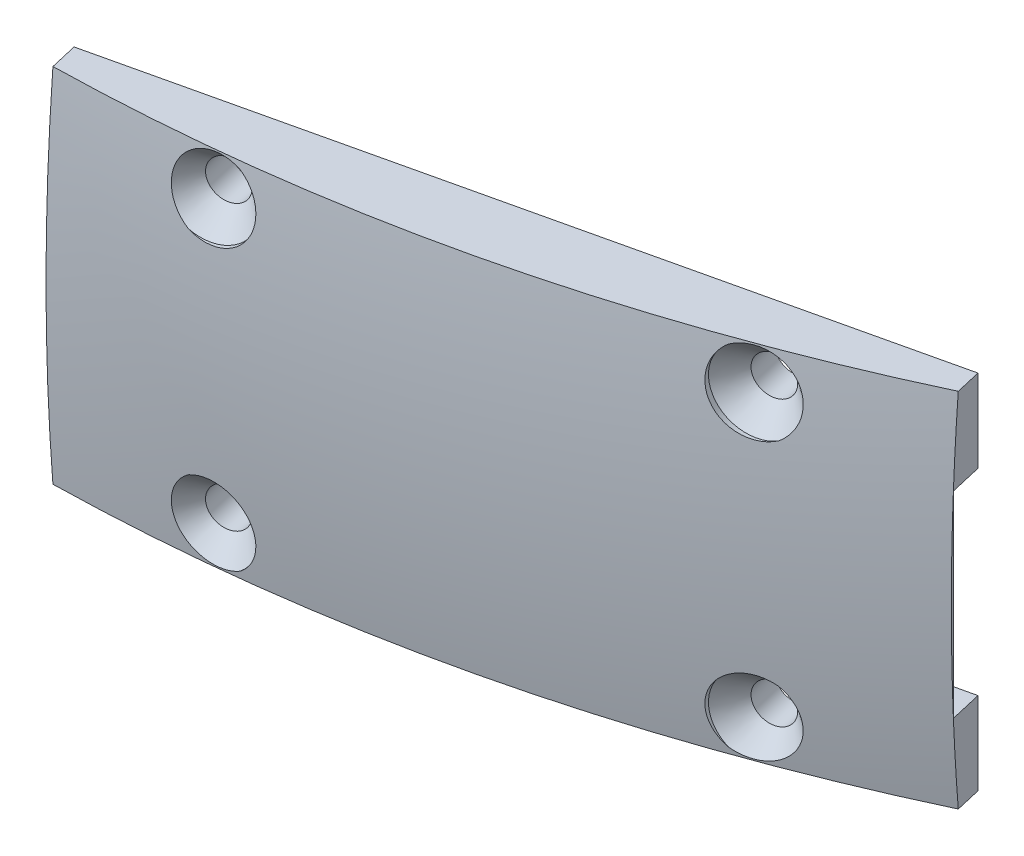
ISO-10303-21;
HEADER;
FILE_DESCRIPTION(('STEP AP214'),'2;1');
FILE_NAME('part.step','',(''),(''),'','','');
FILE_SCHEMA(('AUTOMOTIVE_DESIGN { 1 0 10303 214 1 1 1 1 }'));
ENDSEC;
DATA;
#1=APPLICATION_CONTEXT('core data for automotive mechanical design processes');
#2=APPLICATION_PROTOCOL_DEFINITION('international standard','automotive_design',2000,#1);
#3=PRODUCT_CONTEXT('',#1,'mechanical');
#4=PRODUCT('Part','Part','',(#3));
#5=PRODUCT_RELATED_PRODUCT_CATEGORY('part','',(#4));
#6=PRODUCT_DEFINITION_FORMATION('','',#4);
#7=PRODUCT_DEFINITION_CONTEXT('part definition',#1,'design');
#8=PRODUCT_DEFINITION('design','',#6,#7);
#9=PRODUCT_DEFINITION_SHAPE('','',#8);
#10=(LENGTH_UNIT() NAMED_UNIT(*) SI_UNIT(.MILLI.,.METRE.));
#11=(NAMED_UNIT(*) PLANE_ANGLE_UNIT() SI_UNIT($,.RADIAN.));
#12=(NAMED_UNIT(*) SI_UNIT($,.STERADIAN.) SOLID_ANGLE_UNIT());
#13=UNCERTAINTY_MEASURE_WITH_UNIT(LENGTH_MEASURE(1.E-05),#10,'distance_accuracy_value','');
#14=(GEOMETRIC_REPRESENTATION_CONTEXT(3) GLOBAL_UNCERTAINTY_ASSIGNED_CONTEXT((#13)) GLOBAL_UNIT_ASSIGNED_CONTEXT((#10,
#11,#12)) REPRESENTATION_CONTEXT('',''));
#15=CARTESIAN_POINT('',(0.,0.,0.));
#16=DIRECTION('',(0.,0.,1.));
#17=DIRECTION('',(1.,0.,0.));
#18=AXIS2_PLACEMENT_3D('',#15,#16,#17);
#19=CARTESIAN_POINT('',(244.475000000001,8.255,152.4));
#20=DIRECTION('',(0.,1.,0.));
#21=DIRECTION('',(0.,0.,1.));
#22=AXIS2_PLACEMENT_3D('',#19,#20,#21);
#23=PLANE('',#22);
#24=DIRECTION('',(-0.224951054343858,0.,-0.974370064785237));
#25=VECTOR('',#24,1.);
#26=CARTESIAN_POINT('',(128.521227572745,8.25500000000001,176.421263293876));
#27=LINE('',#26,#25);
#28=CARTESIAN_POINT('',(122.881130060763,8.255,151.991316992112));
#29=VERTEX_POINT('',#28);
#30=CARTESIAN_POINT('',(122.261187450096,8.25500000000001,149.306050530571));
#31=VERTEX_POINT('',#30);
#32=EDGE_CURVE('E169',#29,#31,#27,.T.);
#33=ORIENTED_EDGE('',*,*,#32,.T.);
#34=DIRECTION('',(0.974370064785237,0.,-0.224951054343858));
#35=VECTOR('',#34,1.);
#36=CARTESIAN_POINT('',(237.612468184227,8.255,122.675109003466));
#37=LINE('',#36,#35);
#38=CARTESIAN_POINT('',(183.87203358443,8.25500000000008,135.082065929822));
#39=VERTEX_POINT('',#38);
#40=EDGE_CURVE('E293',#31,#39,#37,.T.);
#41=ORIENTED_EDGE('',*,*,#40,.T.);
#42=DIRECTION('',(-0.224951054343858,0.,-0.974370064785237));
#43=VECTOR('',#42,1.);
#44=CARTESIAN_POINT('',(190.132073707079,8.25500000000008,162.197278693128));
#45=LINE('',#44,#43);
#46=CARTESIAN_POINT('',(184.491976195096,8.255,137.767332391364));
#47=VERTEX_POINT('',#46);
#48=EDGE_CURVE('E164',#47,#39,#45,.T.);
#49=ORIENTED_EDGE('',*,*,#48,.F.);
#50=DIRECTION('',(0.974370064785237,0.,-0.224951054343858));
#51=VECTOR('',#50,1.);
#52=CARTESIAN_POINT('',(121.110929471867,8.255,152.4));
#53=LINE('',#52,#51);
#54=EDGE_CURVE('E167',#29,#47,#53,.T.);
#55=ORIENTED_EDGE('',*,*,#54,.F.);
#56=EDGE_LOOP('',(#33,#41,#49,#55));
#57=FACE_BOUND('',#56,.T.);
#58=ADVANCED_FACE('F36',(#57),#23,.F.);
#59=CARTESIAN_POINT('',(244.475000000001,-8.255,152.4));
#60=DIRECTION('',(0.,1.,0.));
#61=DIRECTION('',(0.,0.,1.));
#62=AXIS2_PLACEMENT_3D('',#59,#60,#61);
#63=PLANE('',#62);
#64=DIRECTION('',(0.974370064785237,0.,-0.224951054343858));
#65=VECTOR('',#64,1.);
#66=CARTESIAN_POINT('',(237.612468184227,-8.255,122.675109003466));
#67=LINE('',#66,#65);
#68=CARTESIAN_POINT('',(122.261187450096,-8.255,149.306050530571));
#69=VERTEX_POINT('',#68);
#70=CARTESIAN_POINT('',(183.87203358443,-8.255,135.082065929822));
#71=VERTEX_POINT('',#70);
#72=EDGE_CURVE('E296',#69,#71,#67,.T.);
#73=ORIENTED_EDGE('',*,*,#72,.F.);
#74=DIRECTION('',(-0.224951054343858,0.,-0.974370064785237));
#75=VECTOR('',#74,1.);
#76=CARTESIAN_POINT('',(128.521227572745,-8.255,176.421263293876));
#77=LINE('',#76,#75);
#78=CARTESIAN_POINT('',(122.881130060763,-8.255,151.991316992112));
#79=VERTEX_POINT('',#78);
#80=EDGE_CURVE('E298',#79,#69,#77,.T.);
#81=ORIENTED_EDGE('',*,*,#80,.F.);
#82=DIRECTION('',(0.974370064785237,0.,-0.224951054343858));
#83=VECTOR('',#82,1.);
#84=CARTESIAN_POINT('',(121.110929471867,-8.255,152.4));
#85=LINE('',#84,#83);
#86=CARTESIAN_POINT('',(184.491976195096,-8.255,137.767332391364));
#87=VERTEX_POINT('',#86);
#88=EDGE_CURVE('E173',#79,#87,#85,.T.);
#89=ORIENTED_EDGE('',*,*,#88,.T.);
#90=DIRECTION('',(-0.224951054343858,0.,-0.974370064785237));
#91=VECTOR('',#90,1.);
#92=CARTESIAN_POINT('',(190.132073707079,-8.255,162.197278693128));
#93=LINE('',#92,#91);
#94=EDGE_CURVE('E300',#87,#71,#93,.T.);
#95=ORIENTED_EDGE('',*,*,#94,.T.);
#96=EDGE_LOOP('',(#73,#81,#89,#95));
#97=FACE_BOUND('',#96,.T.);
#98=ADVANCED_FACE('F233',(#97),#63,.T.);
#99=CARTESIAN_POINT('',(121.110929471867,-8.255,152.4));
#100=DIRECTION('',(0.224951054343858,0.,0.974370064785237));
#101=DIRECTION('',(0.974370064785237,0.,-0.224951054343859));
#102=AXIS2_PLACEMENT_3D('',#99,#100,#101);
#103=PLANE('',#102);
#104=ORIENTED_EDGE('',*,*,#88,.F.);
#105=DIRECTION('',(0.,1.,0.));
#106=VECTOR('',#105,1.);
#107=CARTESIAN_POINT('',(122.881130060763,-8.255,151.991316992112));
#108=LINE('',#107,#106);
#109=EDGE_CURVE('E279',#79,#29,#108,.T.);
#110=ORIENTED_EDGE('',*,*,#109,.T.);
#111=ORIENTED_EDGE('',*,*,#54,.T.);
#112=DIRECTION('',(0.,-1.,0.));
#113=VECTOR('',#112,1.);
#114=CARTESIAN_POINT('',(184.491976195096,-8.255,137.767332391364));
#115=LINE('',#114,#113);
#116=EDGE_CURVE('E287',#47,#87,#115,.T.);
#117=ORIENTED_EDGE('',*,*,#116,.T.);
#118=EDGE_LOOP('',(#104,#110,#111,#117));
#119=FACE_BOUND('',#118,.T.);
#120=ADVANCED_FACE('F219',(#119),#103,.F.);
#121=CARTESIAN_POINT('',(184.543454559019,-15.1765,137.990309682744));
#122=DIRECTION('',(-0.974370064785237,0.,0.224951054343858));
#123=DIRECTION('',(0.224951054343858,0.,0.974370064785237));
#124=AXIS2_PLACEMENT_3D('',#121,#122,#123);
#125=PLANE('',#124);
#126=DIRECTION('',(0.224951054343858,0.,0.974370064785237));
#127=VECTOR('',#126,1.);
#128=CARTESIAN_POINT('',(184.543454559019,-15.1765,137.990309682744));
#129=LINE('',#128,#127);
#130=CARTESIAN_POINT('',(183.87203358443,-15.1765,135.082065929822));
#131=VERTEX_POINT('',#130);
#132=CARTESIAN_POINT('',(184.369141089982,-15.1765,137.235275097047));
#133=VERTEX_POINT('',#132);
#134=EDGE_CURVE('E269',#131,#133,#129,.T.);
#135=ORIENTED_EDGE('',*,*,#134,.F.);
#136=DIRECTION('',(0.,1.,0.));
#137=VECTOR('',#136,1.);
#138=CARTESIAN_POINT('',(183.87203358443,-15.1765,135.082065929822));
#139=LINE('',#138,#137);
#140=EDGE_CURVE('E281',#131,#71,#139,.T.);
#141=ORIENTED_EDGE('',*,*,#140,.T.);
#142=ORIENTED_EDGE('',*,*,#94,.F.);
#143=CARTESIAN_POINT('',(151.0246042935,0.,-7.19578157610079));
#144=DIRECTION('',(-0.974370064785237,0.,0.224951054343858));
#145=DIRECTION('',(0.224951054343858,0.,0.974370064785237));
#146=AXIS2_PLACEMENT_3D('',#143,#144,#145);
#147=CIRCLE('',#146,149.005081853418);
#148=EDGE_CURVE('E292',#133,#87,#147,.T.);
#149=ORIENTED_EDGE('',*,*,#148,.F.);
#150=EDGE_LOOP('',(#135,#141,#142,#149));
#151=FACE_BOUND('',#150,.T.);
#152=ADVANCED_FACE('F217',(#151),#125,.F.);
#153=ORIENTED_EDGE('',*,*,#48,.T.);
#154=CARTESIAN_POINT('',(183.87203358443,15.1765,135.082065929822));
#155=VERTEX_POINT('',#154);
#156=EDGE_CURVE('E275',#39,#155,#139,.T.);
#157=ORIENTED_EDGE('',*,*,#156,.T.);
#158=DIRECTION('',(0.224951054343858,0.,0.974370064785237));
#159=VECTOR('',#158,1.);
#160=CARTESIAN_POINT('',(184.543454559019,15.1765,137.990309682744));
#161=LINE('',#160,#159);
#162=CARTESIAN_POINT('',(184.369141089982,15.1765,137.235275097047));
#163=VERTEX_POINT('',#162);
#164=EDGE_CURVE('E252',#155,#163,#161,.T.);
#165=ORIENTED_EDGE('',*,*,#164,.T.);
#166=EDGE_CURVE('E159',#47,#163,#147,.T.);
#167=ORIENTED_EDGE('',*,*,#166,.F.);
#168=EDGE_LOOP('',(#153,#157,#165,#167));
#169=FACE_BOUND('',#168,.T.);
#170=ADVANCED_FACE('F215',(#169),#125,.F.);
#171=CARTESIAN_POINT('',(122.968146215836,-15.1765,152.368225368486));
#172=DIRECTION('',(0.974370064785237,0.,-0.224951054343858));
#173=DIRECTION('',(-0.224951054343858,0.,-0.974370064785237));
#174=AXIS2_PLACEMENT_3D('',#171,#172,#173);
#175=PLANE('',#174);
#176=DIRECTION('',(-0.224951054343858,0.,-0.974370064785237));
#177=VECTOR('',#176,1.);
#178=CARTESIAN_POINT('',(122.968146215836,15.1765,152.368225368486));
#179=LINE('',#178,#177);
#180=CARTESIAN_POINT('',(122.794018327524,15.1765,151.613994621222));
#181=VERTEX_POINT('',#180);
#182=CARTESIAN_POINT('',(122.261187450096,15.1765,149.306050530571));
#183=VERTEX_POINT('',#182);
#184=EDGE_CURVE('E251',#181,#183,#179,.T.);
#185=ORIENTED_EDGE('',*,*,#184,.T.);
#186=DIRECTION('',(0.,1.,0.));
#187=VECTOR('',#186,1.);
#188=CARTESIAN_POINT('',(122.261187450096,-15.1765,149.306050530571));
#189=LINE('',#188,#187);
#190=EDGE_CURVE('E280',#31,#183,#189,.T.);
#191=ORIENTED_EDGE('',*,*,#190,.F.);
#192=ORIENTED_EDGE('',*,*,#32,.F.);
#193=ORIENTED_EDGE('',*,*,#109,.F.);
#194=ORIENTED_EDGE('',*,*,#80,.T.);
#195=CARTESIAN_POINT('',(122.261187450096,-15.1765,149.306050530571));
#196=VERTEX_POINT('',#195);
#197=EDGE_CURVE('E276',#196,#69,#189,.T.);
#198=ORIENTED_EDGE('',*,*,#197,.F.);
#199=DIRECTION('',(-0.224951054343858,0.,-0.974370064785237));
#200=VECTOR('',#199,1.);
#201=CARTESIAN_POINT('',(122.968146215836,-15.1765,152.368225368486));
#202=LINE('',#201,#200);
#203=CARTESIAN_POINT('',(122.794018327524,-15.1765,151.613994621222));
#204=VERTEX_POINT('',#203);
#205=EDGE_CURVE('E272',#204,#196,#202,.T.);
#206=ORIENTED_EDGE('',*,*,#205,.F.);
#207=CARTESIAN_POINT('',(89.4137581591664,0.,7.02820302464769));
#208=DIRECTION('',(0.974370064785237,0.,-0.224951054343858));
#209=DIRECTION('',(-0.224951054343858,0.,-0.974370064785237));
#210=AXIS2_PLACEMENT_3D('',#207,#208,#209);
#211=CIRCLE('',#210,149.163061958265);
#212=EDGE_CURVE('E156',#181,#204,#211,.T.);
#213=ORIENTED_EDGE('',*,*,#212,.F.);
#214=EDGE_LOOP('',(#185,#191,#192,#193,#194,#198,#206,#213));
#215=FACE_BOUND('',#214,.T.);
#216=ADVANCED_FACE('F211',(#215),#175,.F.);
#217=CARTESIAN_POINT('',(122.261187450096,-15.1765,149.306050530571));
#218=DIRECTION('',(0.224951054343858,0.,0.974370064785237));
#219=DIRECTION('',(0.974370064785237,0.,-0.224951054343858));
#220=AXIS2_PLACEMENT_3D('',#217,#218,#219);
#221=PLANE('',#220);
#222=CARTESIAN_POINT('',(134.497779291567,11.90625,146.481010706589));
#223=DIRECTION('',(-0.224951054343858,0.,-0.974370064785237));
#224=DIRECTION('',(-0.974370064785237,0.,0.224951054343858));
#225=AXIS2_PLACEMENT_3D('',#222,#223,#224);
#226=CIRCLE('',#225,1.63194999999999);
#227=CARTESIAN_POINT('',(132.907656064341,11.90625,146.848119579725));
#228=VERTEX_POINT('',#227);
#229=EDGE_CURVE('E483',#228,#228,#226,.T.);
#230=ORIENTED_EDGE('',*,*,#229,.F.);
#231=EDGE_LOOP('',(#230));
#232=FACE_BOUND('',#231,.T.);
#233=CARTESIAN_POINT('',(171.621278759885,11.90625,137.910375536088));
#234=DIRECTION('',(-0.224951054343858,0.,-0.974370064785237));
#235=DIRECTION('',(-0.974370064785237,0.,0.224951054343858));
#236=AXIS2_PLACEMENT_3D('',#233,#234,#235);
#237=CIRCLE('',#236,1.63194999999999);
#238=CARTESIAN_POINT('',(170.031155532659,11.90625,138.277484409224));
#239=VERTEX_POINT('',#238);
#240=EDGE_CURVE('E261',#239,#239,#237,.T.);
#241=ORIENTED_EDGE('',*,*,#240,.F.);
#242=EDGE_LOOP('',(#241));
#243=FACE_BOUND('',#242,.T.);
#244=ORIENTED_EDGE('',*,*,#190,.T.);
#245=DIRECTION('',(0.974370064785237,0.,-0.224951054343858));
#246=VECTOR('',#245,1.);
#247=CARTESIAN_POINT('',(122.261187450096,15.1765,149.306050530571));
#248=LINE('',#247,#246);
#249=EDGE_CURVE('E250',#183,#155,#248,.T.);
#250=ORIENTED_EDGE('',*,*,#249,.T.);
#251=ORIENTED_EDGE('',*,*,#156,.F.);
#252=ORIENTED_EDGE('',*,*,#40,.F.);
#253=EDGE_LOOP('',(#244,#250,#251,#252));
#254=FACE_BOUND('',#253,.T.);
#255=ADVANCED_FACE('F214',(#232,#243,#254),#221,.F.);
#256=CARTESIAN_POINT('',(171.621278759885,-11.90625,137.910375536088));
#257=DIRECTION('',(-0.224951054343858,0.,-0.974370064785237));
#258=DIRECTION('',(-0.974370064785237,0.,0.224951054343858));
#259=AXIS2_PLACEMENT_3D('',#256,#257,#258);
#260=CIRCLE('',#259,1.63194999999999);
#261=CARTESIAN_POINT('',(170.031155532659,-11.90625,138.277484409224));
#262=VERTEX_POINT('',#261);
#263=EDGE_CURVE('E133',#262,#262,#260,.T.);
#264=ORIENTED_EDGE('',*,*,#263,.F.);
#265=EDGE_LOOP('',(#264));
#266=FACE_BOUND('',#265,.T.);
#267=CARTESIAN_POINT('',(134.497779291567,-11.90625,146.481010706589));
#268=DIRECTION('',(-0.224951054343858,0.,-0.974370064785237));
#269=DIRECTION('',(-0.974370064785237,0.,0.224951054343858));
#270=AXIS2_PLACEMENT_3D('',#267,#268,#269);
#271=CIRCLE('',#270,1.63194999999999);
#272=CARTESIAN_POINT('',(132.907656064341,-11.90625,146.848119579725));
#273=VERTEX_POINT('',#272);
#274=EDGE_CURVE('E494',#273,#273,#271,.T.);
#275=ORIENTED_EDGE('',*,*,#274,.F.);
#276=EDGE_LOOP('',(#275));
#277=FACE_BOUND('',#276,.T.);
#278=ORIENTED_EDGE('',*,*,#72,.T.);
#279=ORIENTED_EDGE('',*,*,#140,.F.);
#280=DIRECTION('',(0.974370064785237,0.,-0.224951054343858));
#281=VECTOR('',#280,1.);
#282=CARTESIAN_POINT('',(122.261187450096,-15.1765,149.306050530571));
#283=LINE('',#282,#281);
#284=EDGE_CURVE('E266',#196,#131,#283,.T.);
#285=ORIENTED_EDGE('',*,*,#284,.F.);
#286=ORIENTED_EDGE('',*,*,#197,.T.);
#287=EDGE_LOOP('',(#278,#279,#285,#286));
#288=FACE_BOUND('',#287,.T.);
#289=ADVANCED_FACE('F221',(#266,#277,#288),#221,.F.);
#290=EDGE_CURVE('E290',#87,#47,#147,.T.);
#291=ORIENTED_EDGE('',*,*,#290,.F.);
#292=ORIENTED_EDGE('',*,*,#116,.F.);
#293=EDGE_LOOP('',(#291,#292));
#294=FACE_BOUND('',#293,.T.);
#295=ADVANCED_FACE('F138',(#294),#125,.F.);
#296=CARTESIAN_POINT('',(119.85625,0.,0.));
#297=DIRECTION('',(-1.,0.,0.));
#298=DIRECTION('',(0.,0.,1.));
#299=AXIS2_PLACEMENT_3D('',#296,#297,#298);
#300=SPHERICAL_SURFACE('',#299,152.4);
#301=CARTESIAN_POINT('',(173.513466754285,-8.54055,142.385821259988));
#302=CARTESIAN_POINT('',(173.590250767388,-8.57232601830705,142.354979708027));
#303=CARTESIAN_POINT('',(173.66578020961,-8.60723809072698,142.324340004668));
#304=CARTESIAN_POINT('',(173.813946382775,-8.68313568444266,142.263621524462));
#305=CARTESIAN_POINT('',(173.886583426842,-8.72412054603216,142.233542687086));
#306=CARTESIAN_POINT('',(174.09955866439,-8.85586888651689,142.144392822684));
#307=CARTESIAN_POINT('',(174.235011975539,-8.95544728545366,142.086387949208));
#308=CARTESIAN_POINT('',(174.503048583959,-9.18747426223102,141.968715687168));
#309=CARTESIAN_POINT('',(174.633789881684,-9.32229407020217,141.909529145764));
#310=CARTESIAN_POINT('',(174.871362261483,-9.61406139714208,141.798116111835));
#311=CARTESIAN_POINT('',(174.978194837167,-9.7710075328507,141.745889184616));
#312=CARTESIAN_POINT('',(175.164309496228,-10.1019375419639,141.650159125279));
#313=CARTESIAN_POINT('',(175.243707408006,-10.2758457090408,141.606619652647));
#314=CARTESIAN_POINT('',(175.373039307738,-10.6363623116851,141.529332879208));
#315=CARTESIAN_POINT('',(175.422972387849,-10.8229711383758,141.495585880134));
#316=CARTESIAN_POINT('',(175.491093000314,-11.2006598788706,141.439409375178));
#317=CARTESIAN_POINT('',(175.509735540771,-11.3916340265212,141.41682108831));
#318=CARTESIAN_POINT('',(175.515850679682,-11.7750760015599,141.38300278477));
#319=CARTESIAN_POINT('',(175.503328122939,-11.9675435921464,141.371771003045));
#320=CARTESIAN_POINT('',(175.44776446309,-12.3446834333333,141.361196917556));
#321=CARTESIAN_POINT('',(175.405296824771,-12.5294341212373,141.361636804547));
#322=CARTESIAN_POINT('',(175.291529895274,-12.8894354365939,141.37392921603));
#323=CARTESIAN_POINT('',(175.220232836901,-13.0646867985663,141.385780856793));
#324=CARTESIAN_POINT('',(175.052022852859,-13.3981254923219,141.420336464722));
#325=CARTESIAN_POINT('',(174.955486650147,-13.55651918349,141.442884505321));
#326=CARTESIAN_POINT('',(174.739122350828,-13.8545073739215,141.498118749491));
#327=CARTESIAN_POINT('',(174.619295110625,-13.9941025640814,141.530804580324));
#328=CARTESIAN_POINT('',(174.36026666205,-14.2501613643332,141.605224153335));
#329=CARTESIAN_POINT('',(174.221130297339,-14.3666993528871,141.646927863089));
#330=CARTESIAN_POINT('',(173.927198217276,-14.5740958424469,141.738219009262));
#331=CARTESIAN_POINT('',(173.772402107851,-14.6649536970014,141.787806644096));
#332=CARTESIAN_POINT('',(173.450120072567,-14.8193723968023,141.893898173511));
#333=CARTESIAN_POINT('',(173.282534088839,-14.8826849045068,141.95045931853));
#334=CARTESIAN_POINT('',(172.940606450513,-14.9793596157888,142.068521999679));
#335=CARTESIAN_POINT('',(172.766264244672,-15.0127193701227,142.130023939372));
#336=CARTESIAN_POINT('',(172.412628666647,-15.0491669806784,142.257322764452));
#337=CARTESIAN_POINT('',(172.233301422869,-15.0517334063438,142.323174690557));
#338=CARTESIAN_POINT('',(171.877511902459,-15.0254385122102,142.456381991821));
#339=CARTESIAN_POINT('',(171.701050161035,-14.9965713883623,142.523737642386));
#340=CARTESIAN_POINT('',(171.352660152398,-14.9076059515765,142.659316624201));
#341=CARTESIAN_POINT('',(171.180871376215,-14.8469528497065,142.727533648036));
#342=CARTESIAN_POINT('',(170.850006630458,-14.6959049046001,142.86169772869));
#343=CARTESIAN_POINT('',(170.690923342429,-14.6055273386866,142.927646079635));
#344=CARTESIAN_POINT('',(170.447864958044,-14.4377213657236,143.030818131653));
#345=CARTESIAN_POINT('',(170.358534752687,-14.3686815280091,143.069334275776));
#346=CARTESIAN_POINT('',(170.187381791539,-14.2211893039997,143.144364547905));
#347=CARTESIAN_POINT('',(170.10554690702,-14.142752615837,143.180881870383));
#348=CARTESIAN_POINT('',(170.027799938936,-14.0599089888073,143.216250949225));
#349=B_SPLINE_CURVE_WITH_KNOTS('',3,(#301,#302,#303,#304,#305,#306,#307,#308,#309,#310,#311,
#312,#313,#314,#315,#316,#317,#318,#319,#320,#321,#322,#323,#324,#325,#326,#327,#328,#329,#330,
#331,#332,#333,#334,#335,#336,#337,#338,#339,#340,#341,#342,#343,#344,#345,#346,#347,#348),
.UNSPECIFIED.,.F.,.F.,(4,2,2,2,2,2,2,2,2,2,2,2,2,2,2,2,2,2,2,2,2,2,2,4),(0.,0.265784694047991,
0.531540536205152,1.06287735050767,1.6508014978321,2.23868890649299,2.82406304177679,
3.40945521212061,3.98625877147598,4.56297266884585,5.12893200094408,5.69484750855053,
6.25275565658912,6.81064329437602,7.36670084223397,7.92277238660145,8.4837582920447,
9.04479006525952,9.61530877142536,10.1859328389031,10.7668655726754,11.3474612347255,
11.7047554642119,12.0614609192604),.UNSPECIFIED.);
#350=CARTESIAN_POINT('',(174.174476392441,-8.91510402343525,142.111967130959));
#351=VERTEX_POINT('',#350);
#352=CARTESIAN_POINT('',(170.755249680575,-14.6374097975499,142.901357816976));
#353=VERTEX_POINT('',#352);
#354=EDGE_CURVE('E49',#351,#353,#349,.T.);
#355=ORIENTED_EDGE('',*,*,#354,.T.);
#356=CARTESIAN_POINT('',(171.853973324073,-15.1767,142.448813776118));
#357=CARTESIAN_POINT('',(171.766411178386,-15.1541127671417,142.483183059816));
#358=CARTESIAN_POINT('',(171.679864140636,-15.1275454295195,142.517506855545));
#359=CARTESIAN_POINT('',(171.509399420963,-15.0666888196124,142.585821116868));
#360=CARTESIAN_POINT('',(171.425481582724,-15.0324000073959,142.619811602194));
#361=CARTESIAN_POINT('',(171.260914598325,-14.956359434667,142.687200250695));
#362=CARTESIAN_POINT('',(171.180263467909,-14.9146122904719,142.720598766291));
#363=CARTESIAN_POINT('',(171.022767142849,-14.8239672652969,142.786578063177));
#364=CARTESIAN_POINT('',(170.94592192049,-14.7750694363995,142.81915885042));
#365=CARTESIAN_POINT('',(170.721856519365,-14.6180877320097,142.91535563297));
#366=CARTESIAN_POINT('',(170.581027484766,-14.4996789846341,142.97745845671));
#367=CARTESIAN_POINT('',(170.320873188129,-14.2388988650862,143.095677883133));
#368=CARTESIAN_POINT('',(170.201543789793,-14.0965321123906,143.151795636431));
#369=CARTESIAN_POINT('',(169.987776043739,-13.7918267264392,143.256458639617));
#370=CARTESIAN_POINT('',(169.893324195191,-13.6294989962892,143.305007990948));
#371=CARTESIAN_POINT('',(169.732076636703,-13.2893773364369,143.393137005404));
#372=CARTESIAN_POINT('',(169.66528406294,-13.1115816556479,143.432715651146));
#373=CARTESIAN_POINT('',(169.561838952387,-12.746960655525,143.50145031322));
#374=CARTESIAN_POINT('',(169.52496974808,-12.5602108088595,143.530680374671));
#375=CARTESIAN_POINT('',(169.48180184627,-12.1818590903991,143.578214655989));
#376=CARTESIAN_POINT('',(169.47549953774,-11.9902577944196,143.596520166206));
#377=CARTESIAN_POINT('',(169.493707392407,-11.6098523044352,143.62148229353));
#378=CARTESIAN_POINT('',(169.517884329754,-11.4210403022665,143.628263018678));
#379=CARTESIAN_POINT('',(169.595917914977,-11.0495838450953,143.630317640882));
#380=CARTESIAN_POINT('',(169.649773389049,-10.8669391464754,143.625591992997));
#381=CARTESIAN_POINT('',(169.785024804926,-10.5148589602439,143.604841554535));
#382=CARTESIAN_POINT('',(169.866150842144,-10.3453133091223,143.588925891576));
#383=CARTESIAN_POINT('',(170.05376255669,-10.0223749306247,143.546358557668));
#384=CARTESIAN_POINT('',(170.160247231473,-9.86898156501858,143.519707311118));
#385=CARTESIAN_POINT('',(170.395018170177,-9.58331611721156,143.456571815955));
#386=CARTESIAN_POINT('',(170.523212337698,-9.45095921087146,143.420128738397));
#387=CARTESIAN_POINT('',(170.798024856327,-9.21028707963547,143.338415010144));
#388=CARTESIAN_POINT('',(170.944643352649,-9.10197204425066,143.29314428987));
#389=CARTESIAN_POINT('',(171.252586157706,-8.91203394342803,143.194928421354));
#390=CARTESIAN_POINT('',(171.413954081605,-8.8304935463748,143.141960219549));
#391=CARTESIAN_POINT('',(171.746432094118,-8.69669543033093,143.029967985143));
#392=CARTESIAN_POINT('',(171.917542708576,-8.6444392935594,142.970943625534));
#393=CARTESIAN_POINT('',(172.266273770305,-8.57016334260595,142.847952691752));
#394=CARTESIAN_POINT('',(172.443938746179,-8.5484180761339,142.783946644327));
#395=CARTESIAN_POINT('',(172.799325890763,-8.53647844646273,142.653268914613));
#396=CARTESIAN_POINT('',(172.977048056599,-8.54628268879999,142.586597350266));
#397=CARTESIAN_POINT('',(173.329547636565,-8.59728888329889,142.45171011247));
#398=CARTESIAN_POINT('',(173.504273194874,-8.6388256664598,142.38348555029));
#399=CARTESIAN_POINT('',(173.844033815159,-8.75246499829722,142.248058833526));
#400=CARTESIAN_POINT('',(174.009063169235,-8.82458534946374,142.180857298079));
#401=CARTESIAN_POINT('',(174.326180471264,-8.99809349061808,142.048788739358));
#402=CARTESIAN_POINT('',(174.478135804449,-9.09974371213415,141.983948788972));
#403=CARTESIAN_POINT('',(174.762847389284,-9.32903673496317,141.859197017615));
#404=CARTESIAN_POINT('',(174.895647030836,-9.45661916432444,141.799274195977));
#405=CARTESIAN_POINT('',(175.046692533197,-9.62918097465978,141.728812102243));
#406=CARTESIAN_POINT('',(175.075713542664,-9.66378276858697,141.715152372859));
#407=CARTESIAN_POINT('',(175.104017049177,-9.69901655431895,141.701705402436));
#408=B_SPLINE_CURVE_WITH_KNOTS('',3,(#356,#357,#358,#359,#360,#361,#362,#363,#364,#365,#366,
#367,#368,#369,#370,#371,#372,#373,#374,#375,#376,#377,#378,#379,#380,#381,#382,#383,#384,#385,
#386,#387,#388,#389,#390,#391,#392,#393,#394,#395,#396,#397,#398,#399,#400,#401,#402,#403,#404,
#405,#406,#407),.UNSPECIFIED.,.F.,.F.,(4,2,2,2,2,2,2,2,2,2,2,2,2,2,2,2,2,2,2,2,2,2,2,2,2,4),(0.,
0.290122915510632,0.58022854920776,0.870155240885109,1.16007982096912,1.73965340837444,
2.31911537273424,2.89826221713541,3.47747471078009,4.05245488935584,4.62736714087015,
5.19604810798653,5.76470658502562,6.32789494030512,6.89106103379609,7.45189530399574,
8.01273399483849,8.5752883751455,9.13787314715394,9.70548848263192,10.2730787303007,
10.8467421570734,11.4207399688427,12.00000367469,12.5779339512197,12.7194338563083),.UNSPECIFIED.);
#409=EDGE_CURVE('E11',#353,#351,#408,.T.);
#410=ORIENTED_EDGE('',*,*,#409,.T.);
#411=EDGE_LOOP('',(#355,#410));
#412=FACE_BOUND('',#411,.T.);
#413=CARTESIAN_POINT('',(138.848114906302,-13.3010940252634,150.625860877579));
#414=CARTESIAN_POINT('',(138.802201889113,-13.380680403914,150.624621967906));
#415=CARTESIAN_POINT('',(138.753141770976,-13.458413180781,150.623859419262));
#416=CARTESIAN_POINT('',(138.649037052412,-13.6097518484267,150.623285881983));
#417=CARTESIAN_POINT('',(138.593993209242,-13.6833582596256,150.623474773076));
#418=CARTESIAN_POINT('',(138.420460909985,-13.897229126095,150.625465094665));
#419=CARTESIAN_POINT('',(138.293468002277,-14.0307243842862,150.628687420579));
#420=CARTESIAN_POINT('',(138.012180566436,-14.2833192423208,150.639127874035));
#421=CARTESIAN_POINT('',(137.856716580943,-14.4011030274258,150.646570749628));
#422=CARTESIAN_POINT('',(137.528575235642,-14.6091951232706,150.665384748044));
#423=CARTESIAN_POINT('',(137.355897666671,-14.6995031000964,150.676755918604));
#424=CARTESIAN_POINT('',(136.997058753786,-14.8505187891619,150.703195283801));
#425=CARTESIAN_POINT('',(136.810821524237,-14.9110424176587,150.718285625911));
#426=CARTESIAN_POINT('',(136.431057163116,-14.999802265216,150.75171642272));
#427=CARTESIAN_POINT('',(136.237529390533,-15.0280356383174,150.770057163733));
#428=CARTESIAN_POINT('',(135.849759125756,-15.0511058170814,150.809382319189));
#429=CARTESIAN_POINT('',(135.655525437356,-15.0461137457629,150.830352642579));
#430=CARTESIAN_POINT('',(135.271019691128,-15.0029959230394,150.874427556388));
#431=CARTESIAN_POINT('',(135.080747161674,-14.9648741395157,150.897531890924));
#432=CARTESIAN_POINT('',(134.712547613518,-14.8571205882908,150.944868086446));
#433=CARTESIAN_POINT('',(134.534480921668,-14.7879569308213,150.969078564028));
#434=CARTESIAN_POINT('',(134.193013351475,-14.6200133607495,151.018241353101));
#435=CARTESIAN_POINT('',(134.029611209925,-14.5212360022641,151.04319360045));
#436=CARTESIAN_POINT('',(133.725153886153,-14.2987691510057,151.092667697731));
#437=CARTESIAN_POINT('',(133.583756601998,-14.1755477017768,151.117189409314));
#438=CARTESIAN_POINT('',(133.324136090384,-13.9066121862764,151.165530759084));
#439=CARTESIAN_POINT('',(133.205910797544,-13.7609001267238,151.189350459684));
#440=CARTESIAN_POINT('',(132.997453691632,-13.4531383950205,151.235301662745));
#441=CARTESIAN_POINT('',(132.906890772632,-13.2913154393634,151.257450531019));
#442=CARTESIAN_POINT('',(132.754342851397,-12.9544824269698,151.299752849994));
#443=CARTESIAN_POINT('',(132.692357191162,-12.7794726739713,151.31990634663));
#444=CARTESIAN_POINT('',(132.598700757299,-12.4216152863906,151.357616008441));
#445=CARTESIAN_POINT('',(132.566973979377,-12.2387827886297,151.375176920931));
#446=CARTESIAN_POINT('',(132.534330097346,-11.8701333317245,151.407267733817));
#447=CARTESIAN_POINT('',(132.533414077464,-11.684316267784,151.421797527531));
#448=CARTESIAN_POINT('',(132.562309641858,-11.3130900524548,151.447565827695));
#449=CARTESIAN_POINT('',(132.592411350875,-11.1277013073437,151.458771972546));
#450=CARTESIAN_POINT('',(132.682677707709,-10.7642085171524,151.477423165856));
#451=CARTESIAN_POINT('',(132.74284372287,-10.5861048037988,151.48486804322));
#452=CARTESIAN_POINT('',(132.892566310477,-10.2391155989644,151.495911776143));
#453=CARTESIAN_POINT('',(132.982587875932,-10.0704287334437,151.499445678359));
#454=CARTESIAN_POINT('',(133.189067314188,-9.74999034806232,151.502376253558));
#455=CARTESIAN_POINT('',(133.305533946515,-9.59824446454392,151.501771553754));
#456=CARTESIAN_POINT('',(133.563713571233,-9.31338354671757,151.496415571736));
#457=CARTESIAN_POINT('',(133.705820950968,-9.18062781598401,151.491594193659));
#458=CARTESIAN_POINT('',(134.009808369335,-8.94058118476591,151.477853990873));
#459=CARTESIAN_POINT('',(134.171665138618,-8.8332607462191,151.468939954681));
#460=CARTESIAN_POINT('',(134.410370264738,-8.70201281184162,151.453685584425));
#461=CARTESIAN_POINT('',(134.48101862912,-8.66624687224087,151.448930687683));
#462=CARTESIAN_POINT('',(134.624417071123,-8.59967611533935,151.438809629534));
#463=CARTESIAN_POINT('',(134.697163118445,-8.56886244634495,151.433444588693));
#464=CARTESIAN_POINT('',(134.770885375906,-8.54055000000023,151.427780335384));
#465=B_SPLINE_CURVE_WITH_KNOTS('',3,(#413,#414,#415,#416,#417,#418,#419,#420,#421,#422,#423,
#424,#425,#426,#427,#428,#429,#430,#431,#432,#433,#434,#435,#436,#437,#438,#439,#440,#441,#442,
#443,#444,#445,#446,#447,#448,#449,#450,#451,#452,#453,#454,#455,#456,#457,#458,#459,#460,#461,
#462,#463,#464),.UNSPECIFIED.,.F.,.F.,(4,2,2,2,2,2,2,2,2,2,2,2,2,2,2,2,2,2,2,2,2,2,2,2,2,4),(0.,
0.275515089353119,0.550995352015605,1.10134190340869,1.68419127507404,2.26704772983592,
2.85346267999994,3.43992931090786,4.02337777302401,4.60675636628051,5.18161873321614,
5.75643153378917,6.32114802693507,6.88581416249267,7.44342963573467,8.00103226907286,
8.55760085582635,9.11418902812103,9.67603093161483,10.2378983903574,10.808963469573,
11.3802179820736,11.9611531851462,12.5414104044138,12.7792468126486,13.0166532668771),.UNSPECIFIED.);
#466=CARTESIAN_POINT('',(137.535846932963,-14.5989355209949,150.66540058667));
#467=VERTEX_POINT('',#466);
#468=CARTESIAN_POINT('',(134.021581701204,-8.93883914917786,151.476732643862));
#469=VERTEX_POINT('',#468);
#470=EDGE_CURVE('E142',#467,#469,#465,.T.);
#471=ORIENTED_EDGE('',*,*,#470,.T.);
#472=CARTESIAN_POINT('',(132.289230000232,-11.1400943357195,151.482934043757));
#473=CARTESIAN_POINT('',(132.312648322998,-11.0471784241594,151.487845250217));
#474=CARTESIAN_POINT('',(132.34001590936,-10.9552390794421,151.49226893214));
#475=CARTESIAN_POINT('',(132.402391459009,-10.7739553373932,151.500116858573));
#476=CARTESIAN_POINT('',(132.437398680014,-10.6846106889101,151.503541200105));
#477=CARTESIAN_POINT('',(132.514762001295,-10.5092259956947,151.509364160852));
#478=CARTESIAN_POINT('',(132.557110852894,-10.423182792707,151.511763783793));
#479=CARTESIAN_POINT('',(132.648836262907,-10.2549340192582,151.51552812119));
#480=CARTESIAN_POINT('',(132.698212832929,-10.1727284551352,151.516892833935));
#481=CARTESIAN_POINT('',(132.856398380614,-9.93270009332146,151.519418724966));
#482=CARTESIAN_POINT('',(132.97531500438,-9.78134858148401,151.519015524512));
#483=CARTESIAN_POINT('',(133.236437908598,-9.50054570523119,151.514048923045));
#484=CARTESIAN_POINT('',(133.378642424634,-9.37109268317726,151.509485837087));
#485=CARTESIAN_POINT('',(133.683284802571,-9.13684599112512,151.496297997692));
#486=CARTESIAN_POINT('',(133.84583585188,-9.03220057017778,151.487649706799));
#487=CARTESIAN_POINT('',(134.185924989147,-8.85152173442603,151.466524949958));
#488=CARTESIAN_POINT('',(134.363465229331,-8.77549243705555,151.454047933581));
#489=CARTESIAN_POINT('',(134.728908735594,-8.65413059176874,151.425583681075));
#490=CARTESIAN_POINT('',(134.916833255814,-8.60886372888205,151.409589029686));
#491=CARTESIAN_POINT('',(135.297343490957,-8.55069339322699,151.374554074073));
#492=CARTESIAN_POINT('',(135.489928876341,-8.53778763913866,151.35551398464));
#493=CARTESIAN_POINT('',(135.873334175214,-8.5448376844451,151.315021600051));
#494=CARTESIAN_POINT('',(136.064158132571,-8.56463959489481,151.293581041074));
#495=CARTESIAN_POINT('',(136.439436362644,-8.63641780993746,151.248825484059));
#496=CARTESIAN_POINT('',(136.623890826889,-8.68839314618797,151.225510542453));
#497=CARTESIAN_POINT('',(136.979307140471,-8.82253094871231,151.177908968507));
#498=CARTESIAN_POINT('',(137.150380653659,-8.90440153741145,151.153633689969));
#499=CARTESIAN_POINT('',(137.475950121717,-9.09616591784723,151.104606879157));
#500=CARTESIAN_POINT('',(137.630447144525,-9.20605790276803,151.079855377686));
#501=CARTESIAN_POINT('',(137.916845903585,-9.44952965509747,151.03084728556));
#502=CARTESIAN_POINT('',(138.048959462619,-9.58285980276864,151.006588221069));
#503=CARTESIAN_POINT('',(138.288621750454,-9.87016473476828,150.959011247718));
#504=CARTESIAN_POINT('',(138.396171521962,-10.0241386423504,150.935693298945));
#505=CARTESIAN_POINT('',(138.583017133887,-10.3473029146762,150.890810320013));
#506=CARTESIAN_POINT('',(138.662483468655,-10.5163933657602,150.869235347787));
#507=CARTESIAN_POINT('',(138.791862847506,-10.8657727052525,150.828288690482));
#508=CARTESIAN_POINT('',(138.841776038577,-11.046061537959,150.808916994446));
#509=CARTESIAN_POINT('',(138.910735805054,-11.4127778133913,150.77290943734));
#510=CARTESIAN_POINT('',(138.929770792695,-11.5992075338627,150.756274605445));
#511=CARTESIAN_POINT('',(138.936535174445,-11.9728852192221,150.72620172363));
#512=CARTESIAN_POINT('',(138.924263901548,-12.160133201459,150.712763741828));
#513=CARTESIAN_POINT('',(138.868726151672,-12.5314822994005,150.689360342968));
#514=CARTESIAN_POINT('',(138.825252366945,-12.7155538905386,150.679418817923));
#515=CARTESIAN_POINT('',(138.70845878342,-13.0741447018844,150.663388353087));
#516=CARTESIAN_POINT('',(138.635137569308,-13.2486634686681,150.657299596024));
#517=CARTESIAN_POINT('',(138.459940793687,-13.5850698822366,150.649078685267));
#518=CARTESIAN_POINT('',(138.357785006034,-13.7468125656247,150.646987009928));
#519=CARTESIAN_POINT('',(138.128183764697,-14.0512611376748,150.646921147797));
#520=CARTESIAN_POINT('',(138.000733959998,-14.1939637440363,150.648947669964));
#521=CARTESIAN_POINT('',(137.72285642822,-14.4576561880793,150.657086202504));
#522=CARTESIAN_POINT('',(137.572220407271,-14.5784250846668,150.663237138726));
#523=CARTESIAN_POINT('',(137.253168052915,-14.7931298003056,150.679486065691));
#524=CARTESIAN_POINT('',(137.084765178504,-14.8870857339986,150.689581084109));
#525=CARTESIAN_POINT('',(136.811419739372,-15.0109572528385,150.708212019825));
#526=CARTESIAN_POINT('',(136.710830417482,-15.050931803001,150.715507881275));
#527=CARTESIAN_POINT('',(136.506586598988,-15.1211482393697,150.731180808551));
#528=CARTESIAN_POINT('',(136.402937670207,-15.151406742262,150.739555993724));
#529=CARTESIAN_POINT('',(136.298080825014,-15.1767,150.748446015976));
#530=B_SPLINE_CURVE_WITH_KNOTS('',3,(#472,#473,#474,#475,#476,#477,#478,#479,#480,#481,#482,
#483,#484,#485,#486,#487,#488,#489,#490,#491,#492,#493,#494,#495,#496,#497,#498,#499,#500,#501,
#502,#503,#504,#505,#506,#507,#508,#509,#510,#511,#512,#513,#514,#515,#516,#517,#518,#519,#520,
#521,#522,#523,#524,#525,#526,#527,#528,#529),.UNSPECIFIED.,.F.,.F.,(4,2,2,2,2,2,2,2,2,2,2,2,2,
2,2,2,2,2,2,2,2,2,2,2,2,2,2,2,4),(0.,0.287744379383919,0.575460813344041,0.862894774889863,
1.1503292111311,1.72481873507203,2.29926475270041,2.87706165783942,3.45494166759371,
4.03405174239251,4.61312099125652,5.18947348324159,5.76580862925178,6.33666102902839,
6.90747662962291,7.47254543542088,8.03759025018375,8.59914324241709,9.16069344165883,
9.72245432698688,10.2842271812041,10.8497673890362,11.4153344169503,11.9865991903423,
12.5579623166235,13.1347952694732,13.7111943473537,14.036219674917,14.3606861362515),.UNSPECIFIED.);
#531=EDGE_CURVE('E130',#469,#467,#530,.T.);
#532=ORIENTED_EDGE('',*,*,#531,.T.);
#533=EDGE_LOOP('',(#471,#532));
#534=FACE_BOUND('',#533,.T.);
#535=CARTESIAN_POINT('',(134.770885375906,8.54055000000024,151.427780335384));
#536=CARTESIAN_POINT('',(134.688282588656,8.57226893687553,151.43412721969));
#537=CARTESIAN_POINT('',(134.606896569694,8.60713904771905,151.440098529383));
#538=CARTESIAN_POINT('',(134.446974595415,8.68298124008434,151.451261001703));
#539=CARTESIAN_POINT('',(134.368438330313,8.72395265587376,151.456452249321));
#540=CARTESIAN_POINT('',(134.137762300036,8.85569543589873,151.470810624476));
#541=CARTESIAN_POINT('',(133.990490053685,8.95532045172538,151.47876739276));
#542=CARTESIAN_POINT('',(133.698351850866,9.18712037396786,151.491885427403));
#543=CARTESIAN_POINT('',(133.555289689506,9.3215886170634,151.496675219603));
#544=CARTESIAN_POINT('',(133.293599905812,9.61257897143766,151.501928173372));
#545=CARTESIAN_POINT('',(133.17497087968,9.76909981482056,151.50239158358));
#546=CARTESIAN_POINT('',(132.966075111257,10.0992505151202,151.498962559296));
#547=CARTESIAN_POINT('',(132.875711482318,10.2728191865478,151.495085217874));
#548=CARTESIAN_POINT('',(132.725638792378,10.6326312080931,151.483081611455));
#549=CARTESIAN_POINT('',(132.66593090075,10.8188750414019,151.4749551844));
#550=CARTESIAN_POINT('',(132.57981416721,11.1960650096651,151.45479874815));
#551=CARTESIAN_POINT('',(132.552967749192,11.3869140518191,151.442822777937));
#552=CARTESIAN_POINT('',(132.532195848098,11.7701317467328,151.415261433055));
#553=CARTESIAN_POINT('',(132.538265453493,11.9625001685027,151.399676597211));
#554=CARTESIAN_POINT('',(132.583000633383,12.3396828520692,151.365642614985));
#555=CARTESIAN_POINT('',(132.62108992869,12.5245704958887,151.347248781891));
#556=CARTESIAN_POINT('',(132.728187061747,12.8848808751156,151.307927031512));
#557=CARTESIAN_POINT('',(132.797192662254,13.060304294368,151.286999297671));
#558=CARTESIAN_POINT('',(132.963034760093,13.394176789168,151.243522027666));
#559=CARTESIAN_POINT('',(133.05947441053,13.552826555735,151.220998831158));
#560=CARTESIAN_POINT('',(133.277782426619,13.8513302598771,151.174726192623));
#561=CARTESIAN_POINT('',(133.399649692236,13.9911850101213,151.150976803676));
#562=CARTESIAN_POINT('',(133.664764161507,14.2476838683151,151.103020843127));
#563=CARTESIAN_POINT('',(133.807929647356,14.3644128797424,151.078816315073));
#564=CARTESIAN_POINT('',(134.111843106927,14.5721698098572,151.030541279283));
#565=CARTESIAN_POINT('',(134.272591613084,14.6631969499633,151.006470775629));
#566=CARTESIAN_POINT('',(134.608399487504,14.8178237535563,150.958938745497));
#567=CARTESIAN_POINT('',(134.783560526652,14.8812043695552,150.935483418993));
#568=CARTESIAN_POINT('',(135.142146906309,14.9780013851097,150.890012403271));
#569=CARTESIAN_POINT('',(135.325572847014,15.0114156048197,150.86799681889));
#570=CARTESIAN_POINT('',(135.698569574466,15.0479203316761,150.825651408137));
#571=CARTESIAN_POINT('',(135.888191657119,15.0505235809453,150.805353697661));
#572=CARTESIAN_POINT('',(136.265512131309,15.0243319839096,150.767376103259));
#573=CARTESIAN_POINT('',(136.453210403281,14.9955351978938,150.749696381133));
#574=CARTESIAN_POINT('',(136.824717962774,14.9067825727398,150.717139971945));
#575=CARTESIAN_POINT('',(137.008408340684,14.8463096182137,150.702315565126));
#576=CARTESIAN_POINT('',(137.363528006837,14.6956953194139,150.676239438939));
#577=CARTESIAN_POINT('',(137.534953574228,14.6055450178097,150.664988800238));
#578=CARTESIAN_POINT('',(137.862600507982,14.3969594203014,150.646264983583));
#579=CARTESIAN_POINT('',(138.018626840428,14.2782141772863,150.638836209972));
#580=CARTESIAN_POINT('',(138.308676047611,14.0163524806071,150.628177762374));
#581=CARTESIAN_POINT('',(138.442724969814,13.8732652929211,150.624943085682));
#582=CARTESIAN_POINT('',(138.616227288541,13.6538074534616,150.623384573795));
#583=CARTESIAN_POINT('',(138.666241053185,13.5855762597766,150.623316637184));
#584=CARTESIAN_POINT('',(138.761085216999,13.4457803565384,150.623986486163));
#585=CARTESIAN_POINT('',(138.805924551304,13.3742217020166,150.624722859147));
#586=CARTESIAN_POINT('',(138.848114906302,13.3010940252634,150.625860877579));
#587=B_SPLINE_CURVE_WITH_KNOTS('',3,(#535,#536,#537,#538,#539,#540,#541,#542,#543,#544,#545,
#546,#547,#548,#549,#550,#551,#552,#553,#554,#555,#556,#557,#558,#559,#560,#561,#562,#563,#564,
#565,#566,#567,#568,#569,#570,#571,#572,#573,#574,#575,#576,#577,#578,#579,#580,#581,#582,#583,
#584,#585,#586),.UNSPECIFIED.,.F.,.F.,(4,2,2,2,2,2,2,2,2,2,2,2,2,2,2,2,2,2,2,2,2,2,2,2,2,4),(0.,
0.26600156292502,0.531974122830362,1.06371118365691,1.65011209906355,2.23647931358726,
2.82081400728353,3.40517098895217,3.98165905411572,4.55806110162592,5.12430599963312,
5.69050992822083,6.24890711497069,6.80728014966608,7.36356356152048,7.91986382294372,
8.48049503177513,9.04116701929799,9.61069408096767,10.1802563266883,10.7594206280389,
11.3387598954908,11.9246862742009,12.5099131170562,12.763519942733,13.0166820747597),.UNSPECIFIED.);
#588=CARTESIAN_POINT('',(134.021581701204,8.938839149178,151.476732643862));
#589=VERTEX_POINT('',#588);
#590=CARTESIAN_POINT('',(137.535846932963,14.5989355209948,150.66540058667));
#591=VERTEX_POINT('',#590);
#592=EDGE_CURVE('E146',#589,#591,#587,.T.);
#593=ORIENTED_EDGE('',*,*,#592,.T.);
#594=CARTESIAN_POINT('',(136.298080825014,15.1767,150.748446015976));
#595=CARTESIAN_POINT('',(136.391691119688,15.1541256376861,150.740509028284));
#596=CARTESIAN_POINT('',(136.484371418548,15.1275755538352,150.732980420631));
#597=CARTESIAN_POINT('',(136.667228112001,15.0667623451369,150.718787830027));
#598=CARTESIAN_POINT('',(136.757404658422,15.0324996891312,150.712123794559));
#599=CARTESIAN_POINT('',(136.934565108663,14.9565211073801,150.699711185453));
#600=CARTESIAN_POINT('',(137.021551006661,14.9148099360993,150.693962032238));
#601=CARTESIAN_POINT('',(137.191751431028,14.8242463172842,150.683414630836));
#602=CARTESIAN_POINT('',(137.274965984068,14.7753939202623,150.678616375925));
#603=CARTESIAN_POINT('',(137.518129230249,14.6185639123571,150.665698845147));
#604=CARTESIAN_POINT('',(137.671683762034,14.5002763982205,150.659050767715));
#605=CARTESIAN_POINT('',(137.956892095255,14.239779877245,150.649901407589));
#606=CARTESIAN_POINT('',(138.088549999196,14.0975753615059,150.647399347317));
#607=CARTESIAN_POINT('',(138.326277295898,13.7931889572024,150.64661724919));
#608=CARTESIAN_POINT('',(138.432352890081,13.6310119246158,150.648336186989));
#609=CARTESIAN_POINT('',(138.615782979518,13.2912175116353,150.655968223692));
#610=CARTESIAN_POINT('',(138.6931341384,13.1135983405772,150.661881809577));
#611=CARTESIAN_POINT('',(138.816303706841,12.7492215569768,150.677704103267));
#612=CARTESIAN_POINT('',(138.862327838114,12.5625323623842,150.687586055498));
#613=CARTESIAN_POINT('',(138.9221606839,12.1842983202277,150.711083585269));
#614=CARTESIAN_POINT('',(138.935973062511,11.9927540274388,150.724698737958));
#615=CARTESIAN_POINT('',(138.930849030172,11.6123217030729,150.755131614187));
#616=CARTESIAN_POINT('',(138.91224455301,11.423426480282,150.771915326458));
#617=CARTESIAN_POINT('',(138.843325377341,11.0517891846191,150.808305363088));
#618=CARTESIAN_POINT('',(138.793011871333,10.8690468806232,150.827911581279));
#619=CARTESIAN_POINT('',(138.66265790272,10.5166956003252,150.869193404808));
#620=CARTESIAN_POINT('',(138.582897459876,10.3469805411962,150.890848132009));
#621=CARTESIAN_POINT('',(138.395852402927,10.023702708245,150.935760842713));
#622=CARTESIAN_POINT('',(138.288568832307,9.87013932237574,150.959018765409));
#623=CARTESIAN_POINT('',(138.0500771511,9.5841618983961,151.006369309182));
#624=CARTESIAN_POINT('',(137.918972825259,9.45166061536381,151.030457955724));
#625=CARTESIAN_POINT('',(137.636302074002,9.21071981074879,151.078878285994));
#626=CARTESIAN_POINT('',(137.484735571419,9.10228037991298,151.103209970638));
#627=CARTESIAN_POINT('',(137.165067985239,8.91217809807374,151.151490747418));
#628=CARTESIAN_POINT('',(136.996925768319,8.83058415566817,151.175438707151));
#629=CARTESIAN_POINT('',(136.64921108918,8.69670244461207,151.222217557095));
#630=CARTESIAN_POINT('',(136.469638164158,8.6444158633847,151.245048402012));
#631=CARTESIAN_POINT('',(136.102592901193,8.57014119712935,151.289143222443));
#632=CARTESIAN_POINT('',(135.915067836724,8.54840523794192,151.310392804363));
#633=CARTESIAN_POINT('',(135.538769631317,8.53648145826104,151.350529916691));
#634=CARTESIAN_POINT('',(135.349996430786,8.54629515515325,151.369417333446));
#635=CARTESIAN_POINT('',(134.974478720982,8.5973217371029,151.404497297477));
#636=CARTESIAN_POINT('',(134.787775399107,8.63885838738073,151.420659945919));
#637=CARTESIAN_POINT('',(134.423618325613,8.75244627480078,151.449605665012));
#638=CARTESIAN_POINT('',(134.246164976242,8.82449883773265,151.462388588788));
#639=CARTESIAN_POINT('',(133.904065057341,8.99774736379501,151.484311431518));
#640=CARTESIAN_POINT('',(133.739532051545,9.09917141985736,151.493421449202));
#641=CARTESIAN_POINT('',(133.429483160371,9.32808738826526,151.507594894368));
#642=CARTESIAN_POINT('',(133.283970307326,9.4555834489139,151.512657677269));
#643=CARTESIAN_POINT('',(133.015800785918,9.73340462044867,151.518594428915));
#644=CARTESIAN_POINT('',(132.893204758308,9.88378844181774,151.519457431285));
#645=CARTESIAN_POINT('',(132.674988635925,10.2028807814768,151.516924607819));
#646=CARTESIAN_POINT('',(132.579344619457,10.3715728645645,151.513532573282));
#647=CARTESIAN_POINT('',(132.454650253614,10.6424077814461,151.505084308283));
#648=CARTESIAN_POINT('',(132.415103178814,10.7398956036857,151.501488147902));
#649=CARTESIAN_POINT('',(132.345221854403,10.9378869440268,151.493099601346));
#650=CARTESIAN_POINT('',(132.314872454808,11.0383852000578,151.488309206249));
#651=CARTESIAN_POINT('',(132.289230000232,11.1400943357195,151.482934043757));
#652=B_SPLINE_CURVE_WITH_KNOTS('',3,(#594,#595,#596,#597,#598,#599,#600,#601,#602,#603,#604,
#605,#606,#607,#608,#609,#610,#611,#612,#613,#614,#615,#616,#617,#618,#619,#620,#621,#622,#623,
#624,#625,#626,#627,#628,#629,#630,#631,#632,#633,#634,#635,#636,#637,#638,#639,#640,#641,#642,
#643,#644,#645,#646,#647,#648,#649,#650,#651),.UNSPECIFIED.,.F.,.F.,(4,2,2,2,2,2,2,2,2,2,2,2,2,
2,2,2,2,2,2,2,2,2,2,2,2,2,2,2,4),(0.,0.289764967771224,0.579512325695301,0.869075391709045,
1.1586364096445,1.73747975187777,2.3162145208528,2.89480885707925,3.47347037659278,
4.04829423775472,4.62305270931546,5.19196044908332,5.76084679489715,6.32445720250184,
6.8880462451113,7.44923623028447,8.01042833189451,8.57304989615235,9.13569425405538,
9.70295522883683,10.2702434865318,10.8434001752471,11.4165817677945,11.9943397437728,
12.572189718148,13.1515477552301,13.7303899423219,14.0457827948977,14.3606532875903),.UNSPECIFIED.);
#653=EDGE_CURVE('E466',#591,#589,#652,.T.);
#654=ORIENTED_EDGE('',*,*,#653,.T.);
#655=EDGE_LOOP('',(#593,#654));
#656=FACE_BOUND('',#655,.T.);
#657=CARTESIAN_POINT('',(175.104017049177,9.69901655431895,141.701705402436));
#658=CARTESIAN_POINT('',(175.045945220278,9.6267299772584,141.729294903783));
#659=CARTESIAN_POINT('',(174.984915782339,9.55715818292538,141.757752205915));
#660=CARTESIAN_POINT('',(174.857410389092,9.42390187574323,141.816190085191));
#661=CARTESIAN_POINT('',(174.790934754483,9.36021701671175,141.846170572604));
#662=CARTESIAN_POINT('',(174.653040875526,9.23922066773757,141.907427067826));
#663=CARTESIAN_POINT('',(174.581625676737,9.18190530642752,141.938702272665));
#664=CARTESIAN_POINT('',(174.434357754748,9.07401532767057,142.002330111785));
#665=CARTESIAN_POINT('',(174.358505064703,9.02344065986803,142.034682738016));
#666=CARTESIAN_POINT('',(174.12500154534,8.88234950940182,142.133049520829));
#667=CARTESIAN_POINT('',(173.961339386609,8.80240818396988,142.200401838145));
#668=CARTESIAN_POINT('',(173.62301480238,8.67334020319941,142.336592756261));
#669=CARTESIAN_POINT('',(173.448354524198,8.62420755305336,142.405431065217));
#670=CARTESIAN_POINT('',(173.092968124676,8.55817906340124,142.542648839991));
#671=CARTESIAN_POINT('',(172.912246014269,8.54126231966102,142.611028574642));
#672=CARTESIAN_POINT('',(172.549799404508,8.54026053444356,142.745406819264));
#673=CARTESIAN_POINT('',(172.368074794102,8.556179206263,142.811405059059));
#674=CARTESIAN_POINT('',(172.010252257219,8.62033016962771,142.938611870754));
#675=CARTESIAN_POINT('',(171.834122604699,8.66832202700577,142.99985232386));
#676=CARTESIAN_POINT('',(171.491236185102,8.79517073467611,143.116281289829));
#677=CARTESIAN_POINT('',(171.324478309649,8.87402392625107,143.171470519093));
#678=CARTESIAN_POINT('',(171.006992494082,9.05943437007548,143.27359909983));
#679=CARTESIAN_POINT('',(170.856110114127,9.16568140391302,143.320621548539));
#680=CARTESIAN_POINT('',(170.572753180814,9.4033234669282,143.405752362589));
#681=CARTESIAN_POINT('',(170.440277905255,9.53471750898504,143.443861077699));
#682=CARTESIAN_POINT('',(170.198804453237,9.81753758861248,143.509715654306));
#683=CARTESIAN_POINT('',(170.089594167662,9.96876035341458,143.537556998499));
#684=CARTESIAN_POINT('',(169.896214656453,10.2878792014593,143.582578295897));
#685=CARTESIAN_POINT('',(169.81204445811,10.4557746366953,143.599758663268));
#686=CARTESIAN_POINT('',(169.671411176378,10.802721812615,143.622929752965));
#687=CARTESIAN_POINT('',(169.614838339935,10.981726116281,143.62896506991));
#688=CARTESIAN_POINT('',(169.530419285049,11.346406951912,143.629840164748));
#689=CARTESIAN_POINT('',(169.502573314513,11.5320835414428,143.624679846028));
#690=CARTESIAN_POINT('',(169.476227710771,11.905469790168,143.603317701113));
#691=CARTESIAN_POINT('',(169.47782204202,12.0931840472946,143.58708068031));
#692=CARTESIAN_POINT('',(169.510386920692,12.4648122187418,143.544036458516));
#693=CARTESIAN_POINT('',(169.541359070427,12.6487259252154,143.517228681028));
#694=CARTESIAN_POINT('',(169.632068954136,13.0093096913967,143.453552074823));
#695=CARTESIAN_POINT('',(169.692063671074,13.1858994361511,143.416594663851));
#696=CARTESIAN_POINT('',(169.839089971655,13.5251746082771,143.333810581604));
#697=CARTESIAN_POINT('',(169.926120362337,13.687860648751,143.287984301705));
#698=CARTESIAN_POINT('',(170.12575835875,13.9965737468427,143.188229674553));
#699=CARTESIAN_POINT('',(170.238629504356,14.1424040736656,143.134219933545));
#700=CARTESIAN_POINT('',(170.486253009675,14.4114343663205,143.019963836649));
#701=CARTESIAN_POINT('',(170.621018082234,14.5346210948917,142.959713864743));
#702=CARTESIAN_POINT('',(170.909866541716,14.7558710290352,142.834134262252));
#703=CARTESIAN_POINT('',(171.06411427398,14.8536958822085,142.768763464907));
#704=CARTESIAN_POINT('',(171.386365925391,15.0198023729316,142.635373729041));
#705=CARTESIAN_POINT('',(171.5543373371,15.0881515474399,142.567361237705));
#706=CARTESIAN_POINT('',(171.768866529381,15.1537382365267,142.482303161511));
#707=CARTESIAN_POINT('',(171.811308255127,15.1656957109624,142.46556024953));
#708=CARTESIAN_POINT('',(171.853973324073,15.1767,142.448813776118));
#709=B_SPLINE_CURVE_WITH_KNOTS('',3,(#657,#658,#659,#660,#661,#662,#663,#664,#665,#666,#667,
#668,#669,#670,#671,#672,#673,#674,#675,#676,#677,#678,#679,#680,#681,#682,#683,#684,#685,#686,
#687,#688,#689,#690,#691,#692,#693,#694,#695,#696,#697,#698,#699,#700,#701,#702,#703,#704,#705,
#706,#707,#708),.UNSPECIFIED.,.F.,.F.,(4,2,2,2,2,2,2,2,2,2,2,2,2,2,2,2,2,2,2,2,2,2,2,2,2,4),(0.,
0.290127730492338,0.580238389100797,0.8701717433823,1.16010293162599,1.73969179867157,
2.31916785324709,2.89826776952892,3.47743317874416,4.05230490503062,4.6271084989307,
5.19566870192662,5.76420659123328,6.32731535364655,6.89040223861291,7.45123112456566,
8.01206485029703,8.57468889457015,9.13734362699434,9.7050742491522,10.2727798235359,
10.846555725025,11.4206659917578,11.9999907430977,12.5779809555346,12.7194336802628),.UNSPECIFIED.);
#710=CARTESIAN_POINT('',(174.174476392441,8.91510402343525,142.111967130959));
#711=VERTEX_POINT('',#710);
#712=CARTESIAN_POINT('',(170.755249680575,14.6374097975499,142.901357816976));
#713=VERTEX_POINT('',#712);
#714=EDGE_CURVE('E150',#711,#713,#709,.T.);
#715=ORIENTED_EDGE('',*,*,#714,.T.);
#716=CARTESIAN_POINT('',(170.027799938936,14.0599089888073,143.216250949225));
#717=CARTESIAN_POINT('',(170.086098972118,14.1220217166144,143.189729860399));
#718=CARTESIAN_POINT('',(170.14668895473,14.1816609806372,143.162565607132));
#719=CARTESIAN_POINT('',(170.272117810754,14.2956961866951,143.107097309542));
#720=CARTESIAN_POINT('',(170.336956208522,14.3500927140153,143.07879339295));
#721=CARTESIAN_POINT('',(170.537305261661,14.5049475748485,142.992408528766));
#722=CARTESIAN_POINT('',(170.678702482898,14.5971272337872,142.932830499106));
#723=CARTESIAN_POINT('',(170.988307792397,14.7649508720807,142.80513778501));
#724=CARTESIAN_POINT('',(171.157784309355,14.8380539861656,142.736761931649));
#725=CARTESIAN_POINT('',(171.506706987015,14.9525705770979,142.598910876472));
#726=CARTESIAN_POINT('',(171.686152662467,14.9939855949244,142.529435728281));
#727=CARTESIAN_POINT('',(172.049450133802,15.0436812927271,142.391557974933));
#728=CARTESIAN_POINT('',(172.233289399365,15.0520469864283,142.323153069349));
#729=CARTESIAN_POINT('',(172.600532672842,15.035359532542,142.18922911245));
#730=CARTESIAN_POINT('',(172.783936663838,15.0103051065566,142.12371017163));
#731=CARTESIAN_POINT('',(173.142424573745,14.9277566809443,141.998390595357));
#732=CARTESIAN_POINT('',(173.317587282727,14.8707041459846,141.938524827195));
#733=CARTESIAN_POINT('',(173.656968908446,14.7258492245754,141.825347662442));
#734=CARTESIAN_POINT('',(173.821189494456,14.6380515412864,141.77203526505));
#735=CARTESIAN_POINT('',(174.130781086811,14.4359687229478,141.674535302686));
#736=CARTESIAN_POINT('',(174.276445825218,14.3222064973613,141.630196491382));
#737=CARTESIAN_POINT('',(174.548061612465,14.0704861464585,141.55077892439));
#738=CARTESIAN_POINT('',(174.674014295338,13.9325300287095,141.515699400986));
#739=CARTESIAN_POINT('',(174.90066533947,13.6386705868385,141.456331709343));
#740=CARTESIAN_POINT('',(175.001720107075,13.4830736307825,141.431886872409));
#741=CARTESIAN_POINT('',(175.178120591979,13.1567351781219,141.393725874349));
#742=CARTESIAN_POINT('',(175.253467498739,12.9859943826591,141.380009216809));
#743=CARTESIAN_POINT('',(175.376051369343,12.6351819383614,141.363709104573));
#744=CARTESIAN_POINT('',(175.423428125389,12.4551616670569,141.361069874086));
#745=CARTESIAN_POINT('',(175.489483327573,12.0901092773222,141.36678189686));
#746=CARTESIAN_POINT('',(175.508161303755,11.9050770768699,141.375133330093));
#747=CARTESIAN_POINT('',(175.51654766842,11.5338165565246,141.402606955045));
#748=CARTESIAN_POINT('',(175.506045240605,11.3475892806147,141.421806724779));
#749=CARTESIAN_POINT('',(175.456174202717,10.9804108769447,141.470399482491));
#750=CARTESIAN_POINT('',(175.41680339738,10.7994601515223,141.499793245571));
#751=CARTESIAN_POINT('',(175.309667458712,10.4448411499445,141.56842811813));
#752=CARTESIAN_POINT('',(175.241454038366,10.271337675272,141.607820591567));
#753=CARTESIAN_POINT('',(175.078703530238,9.93943367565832,141.695039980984));
#754=CARTESIAN_POINT('',(174.984161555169,9.78103596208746,141.742868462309));
#755=CARTESIAN_POINT('',(174.76955246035,9.4808006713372,141.846540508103));
#756=CARTESIAN_POINT('',(174.649046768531,9.33932236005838,141.902515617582));
#757=CARTESIAN_POINT('',(174.387058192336,9.08025498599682,142.020200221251));
#758=CARTESIAN_POINT('',(174.245587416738,8.96265222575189,142.081906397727));
#759=CARTESIAN_POINT('',(174.004242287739,8.79512044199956,142.184439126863));
#760=CARTESIAN_POINT('',(173.90963910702,8.73667767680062,142.224032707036));
#761=CARTESIAN_POINT('',(173.715245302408,8.63050276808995,142.304240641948));
#762=CARTESIAN_POINT('',(173.615463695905,8.58275272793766,142.3448531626));
#763=CARTESIAN_POINT('',(173.513466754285,8.54055000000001,142.385821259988));
#764=B_SPLINE_CURVE_WITH_KNOTS('',3,(#716,#717,#718,#719,#720,#721,#722,#723,#724,#725,#726,
#727,#728,#729,#730,#731,#732,#733,#734,#735,#736,#737,#738,#739,#740,#741,#742,#743,#744,#745,
#746,#747,#748,#749,#750,#751,#752,#753,#754,#755,#756,#757,#758,#759,#760,#761,#762,#763),
.UNSPECIFIED.,.F.,.F.,(4,2,2,2,2,2,2,2,2,2,2,2,2,2,2,2,2,2,2,2,2,2,2,4),(0.,0.267526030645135,
0.535022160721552,1.06977524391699,1.65747472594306,2.24514562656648,2.83130385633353,
3.41748450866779,3.99577005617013,4.57396718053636,5.14141239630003,5.70881054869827,
6.2675407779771,6.82624515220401,7.38213300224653,7.93802995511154,8.49795345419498,
9.05791953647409,9.62692881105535,10.1960437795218,10.7756541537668,11.3549310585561,
11.7084917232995,12.0614561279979),.UNSPECIFIED.);
#765=EDGE_CURVE('E183',#713,#711,#764,.T.);
#766=ORIENTED_EDGE('',*,*,#765,.T.);
#767=EDGE_LOOP('',(#715,#766));
#768=FACE_BOUND('',#767,.T.);
#769=CARTESIAN_POINT('',(119.85625,15.1765,0.));
#770=DIRECTION('',(0.,-1.,0.));
#771=DIRECTION('',(0.,0.,-1.));
#772=AXIS2_PLACEMENT_3D('',#769,#770,#771);
#773=CIRCLE('',#772,151.642453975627);
#774=EDGE_CURVE('E154',#181,#163,#773,.F.);
#775=ORIENTED_EDGE('',*,*,#774,.F.);
#776=ORIENTED_EDGE('',*,*,#212,.T.);
#777=CARTESIAN_POINT('',(119.85625,-15.1765,0.));
#778=DIRECTION('',(0.,1.,0.));
#779=DIRECTION('',(0.,0.,1.));
#780=AXIS2_PLACEMENT_3D('',#777,#778,#779);
#781=CIRCLE('',#780,151.642453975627);
#782=EDGE_CURVE('E163',#133,#204,#781,.F.);
#783=ORIENTED_EDGE('',*,*,#782,.F.);
#784=ORIENTED_EDGE('',*,*,#148,.T.);
#785=ORIENTED_EDGE('',*,*,#290,.T.);
#786=ORIENTED_EDGE('',*,*,#166,.T.);
#787=EDGE_LOOP('',(#775,#776,#783,#784,#785,#786));
#788=FACE_BOUND('',#787,.T.);
#789=ADVANCED_FACE('F135',(#412,#534,#656,#768,#788),#300,.T.);
#790=CARTESIAN_POINT('',(232.568750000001,-15.1765,82.55));
#791=DIRECTION('',(0.,1.,0.));
#792=DIRECTION('',(0.,0.,1.));
#793=AXIS2_PLACEMENT_3D('',#790,#791,#792);
#794=PLANE('',#793);
#795=ORIENTED_EDGE('',*,*,#782,.T.);
#796=ORIENTED_EDGE('',*,*,#205,.T.);
#797=ORIENTED_EDGE('',*,*,#284,.T.);
#798=ORIENTED_EDGE('',*,*,#134,.T.);
#799=EDGE_LOOP('',(#795,#796,#797,#798));
#800=FACE_BOUND('',#799,.T.);
#801=ADVANCED_FACE('F38',(#800),#794,.F.);
#802=CARTESIAN_POINT('',(232.568750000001,15.1765,152.4));
#803=DIRECTION('',(0.,-1.,0.));
#804=DIRECTION('',(0.,0.,-1.));
#805=AXIS2_PLACEMENT_3D('',#802,#803,#804);
#806=PLANE('',#805);
#807=ORIENTED_EDGE('',*,*,#249,.F.);
#808=ORIENTED_EDGE('',*,*,#184,.F.);
#809=ORIENTED_EDGE('',*,*,#774,.T.);
#810=ORIENTED_EDGE('',*,*,#164,.F.);
#811=EDGE_LOOP('',(#807,#808,#809,#810));
#812=FACE_BOUND('',#811,.T.);
#813=ADVANCED_FACE('F209',(#812),#806,.F.);
#814=CARTESIAN_POINT('',(172.222804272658,11.90625,140.515868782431));
#815=DIRECTION('',(0.224951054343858,0.,0.974370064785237));
#816=DIRECTION('',(0.974370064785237,0.,-0.224951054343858));
#817=AXIS2_PLACEMENT_3D('',#814,#815,#816);
#818=CONICAL_SURFACE('',#817,1.63195,0.715584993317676);
#819=CARTESIAN_POINT('',(172.222804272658,11.90625,140.515868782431));
#820=DIRECTION('',(-0.224951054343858,0.,-0.974370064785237));
#821=DIRECTION('',(-0.974370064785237,0.,0.224951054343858));
#822=AXIS2_PLACEMENT_3D('',#819,#820,#821);
#823=CIRCLE('',#822,1.63195);
#824=CARTESIAN_POINT('',(170.632681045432,11.90625,140.882977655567));
#825=VERTEX_POINT('',#824);
#826=EDGE_CURVE('E257',#825,#825,#823,.T.);
#827=ORIENTED_EDGE('',*,*,#826,.T.);
#828=EDGE_LOOP('',(#827));
#829=FACE_BOUND('',#828,.T.);
#830=CARTESIAN_POINT('',(172.671406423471,11.90625,142.45897817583));
#831=DIRECTION('',(-0.224951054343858,0.,-0.974370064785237));
#832=DIRECTION('',(-0.974370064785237,0.,0.224951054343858));
#833=AXIS2_PLACEMENT_3D('',#830,#831,#832);
#834=CIRCLE('',#833,3.3655);
#835=EDGE_CURVE('E478',#711,#713,#834,.T.);
#836=ORIENTED_EDGE('',*,*,#835,.F.);
#837=ORIENTED_EDGE('',*,*,#765,.F.);
#838=EDGE_LOOP('',(#836,#837));
#839=FACE_BOUND('',#838,.T.);
#840=ADVANCED_FACE('F198',(#829,#839),#818,.F.);
#841=CARTESIAN_POINT('',(172.671406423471,11.90625,142.45897817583));
#842=DIRECTION('',(-0.224951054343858,0.,-0.974370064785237));
#843=DIRECTION('',(-0.974370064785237,0.,0.224951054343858));
#844=AXIS2_PLACEMENT_3D('',#841,#842,#843);
#845=CYLINDRICAL_SURFACE('',#844,3.3655);
#846=ORIENTED_EDGE('',*,*,#835,.T.);
#847=ORIENTED_EDGE('',*,*,#714,.F.);
#848=EDGE_LOOP('',(#846,#847));
#849=FACE_BOUND('',#848,.T.);
#850=ADVANCED_FACE('F192',(#849),#845,.F.);
#851=CARTESIAN_POINT('',(171.621278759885,11.90625,137.910375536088));
#852=DIRECTION('',(-0.224951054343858,0.,-0.974370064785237));
#853=DIRECTION('',(-0.974370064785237,0.,0.224951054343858));
#854=AXIS2_PLACEMENT_3D('',#851,#852,#853);
#855=CYLINDRICAL_SURFACE('',#854,1.63194999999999);
#856=ORIENTED_EDGE('',*,*,#826,.F.);
#857=EDGE_LOOP('',(#856));
#858=FACE_BOUND('',#857,.T.);
#859=ORIENTED_EDGE('',*,*,#240,.T.);
#860=EDGE_LOOP('',(#859));
#861=FACE_BOUND('',#860,.T.);
#862=ADVANCED_FACE('F197',(#858,#861),#855,.F.);
#863=CARTESIAN_POINT('',(135.568672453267,11.90625,151.119558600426));
#864=DIRECTION('',(-0.224951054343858,0.,-0.974370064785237));
#865=DIRECTION('',(-0.974370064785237,0.,0.224951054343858));
#866=AXIS2_PLACEMENT_3D('',#863,#864,#865);
#867=CYLINDRICAL_SURFACE('',#866,3.3655);
#868=CARTESIAN_POINT('',(135.568672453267,11.90625,151.119558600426));
#869=DIRECTION('',(-0.224951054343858,0.,-0.974370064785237));
#870=DIRECTION('',(-0.974370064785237,0.,0.224951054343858));
#871=AXIS2_PLACEMENT_3D('',#868,#869,#870);
#872=CIRCLE('',#871,3.3655);
#873=EDGE_CURVE('E488',#591,#589,#872,.T.);
#874=ORIENTED_EDGE('',*,*,#873,.T.);
#875=ORIENTED_EDGE('',*,*,#653,.F.);
#876=EDGE_LOOP('',(#874,#875));
#877=FACE_BOUND('',#876,.T.);
#878=ADVANCED_FACE('F204',(#877),#867,.F.);
#879=CARTESIAN_POINT('',(135.120070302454,11.90625,149.176449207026));
#880=DIRECTION('',(0.224951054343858,0.,0.974370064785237));
#881=DIRECTION('',(0.974370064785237,0.,-0.224951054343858));
#882=AXIS2_PLACEMENT_3D('',#879,#880,#881);
#883=CONICAL_SURFACE('',#882,1.63195,0.715584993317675);
#884=CARTESIAN_POINT('',(135.120070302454,11.90625,149.176449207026));
#885=DIRECTION('',(-0.224951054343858,0.,-0.974370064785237));
#886=DIRECTION('',(-0.974370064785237,0.,0.224951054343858));
#887=AXIS2_PLACEMENT_3D('',#884,#885,#886);
#888=CIRCLE('',#887,1.63195);
#889=CARTESIAN_POINT('',(133.529947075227,11.90625,149.543558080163));
#890=VERTEX_POINT('',#889);
#891=EDGE_CURVE('E479',#890,#890,#888,.T.);
#892=ORIENTED_EDGE('',*,*,#891,.T.);
#893=EDGE_LOOP('',(#892));
#894=FACE_BOUND('',#893,.T.);
#895=ORIENTED_EDGE('',*,*,#873,.F.);
#896=ORIENTED_EDGE('',*,*,#592,.F.);
#897=EDGE_LOOP('',(#895,#896));
#898=FACE_BOUND('',#897,.T.);
#899=ADVANCED_FACE('F200',(#894,#898),#883,.F.);
#900=CARTESIAN_POINT('',(134.497779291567,11.90625,146.481010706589));
#901=DIRECTION('',(-0.224951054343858,0.,-0.974370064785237));
#902=DIRECTION('',(-0.974370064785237,0.,0.224951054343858));
#903=AXIS2_PLACEMENT_3D('',#900,#901,#902);
#904=CYLINDRICAL_SURFACE('',#903,1.63194999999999);
#905=ORIENTED_EDGE('',*,*,#891,.F.);
#906=EDGE_LOOP('',(#905));
#907=FACE_BOUND('',#906,.T.);
#908=ORIENTED_EDGE('',*,*,#229,.T.);
#909=EDGE_LOOP('',(#908));
#910=FACE_BOUND('',#909,.T.);
#911=ADVANCED_FACE('F381',(#907,#910),#904,.F.);
#912=CARTESIAN_POINT('',(135.568672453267,-11.90625,151.119558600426));
#913=DIRECTION('',(-0.224951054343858,0.,-0.974370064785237));
#914=DIRECTION('',(-0.974370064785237,0.,0.224951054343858));
#915=AXIS2_PLACEMENT_3D('',#912,#913,#914);
#916=CYLINDRICAL_SURFACE('',#915,3.3655);
#917=CARTESIAN_POINT('',(135.568672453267,-11.90625,151.119558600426));
#918=DIRECTION('',(-0.224951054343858,0.,-0.974370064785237));
#919=DIRECTION('',(-0.974370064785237,0.,0.224951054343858));
#920=AXIS2_PLACEMENT_3D('',#917,#918,#919);
#921=CIRCLE('',#920,3.3655);
#922=EDGE_CURVE('E62',#469,#467,#921,.T.);
#923=ORIENTED_EDGE('',*,*,#922,.T.);
#924=ORIENTED_EDGE('',*,*,#531,.F.);
#925=EDGE_LOOP('',(#923,#924));
#926=FACE_BOUND('',#925,.T.);
#927=ADVANCED_FACE('F390',(#926),#916,.F.);
#928=CARTESIAN_POINT('',(135.120070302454,-11.90625,149.176449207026));
#929=DIRECTION('',(0.224951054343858,0.,0.974370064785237));
#930=DIRECTION('',(0.974370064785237,0.,-0.224951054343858));
#931=AXIS2_PLACEMENT_3D('',#928,#929,#930);
#932=CONICAL_SURFACE('',#931,1.63195,0.715584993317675);
#933=CARTESIAN_POINT('',(135.120070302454,-11.90625,149.176449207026));
#934=DIRECTION('',(-0.224951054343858,0.,-0.974370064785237));
#935=DIRECTION('',(-0.974370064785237,0.,0.224951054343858));
#936=AXIS2_PLACEMENT_3D('',#933,#934,#935);
#937=CIRCLE('',#936,1.63195);
#938=CARTESIAN_POINT('',(133.529947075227,-11.90625,149.543558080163));
#939=VERTEX_POINT('',#938);
#940=EDGE_CURVE('E491',#939,#939,#937,.T.);
#941=ORIENTED_EDGE('',*,*,#940,.T.);
#942=EDGE_LOOP('',(#941));
#943=FACE_BOUND('',#942,.T.);
#944=ORIENTED_EDGE('',*,*,#922,.F.);
#945=ORIENTED_EDGE('',*,*,#470,.F.);
#946=EDGE_LOOP('',(#944,#945));
#947=FACE_BOUND('',#946,.T.);
#948=ADVANCED_FACE('F399',(#943,#947),#932,.F.);
#949=CARTESIAN_POINT('',(134.497779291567,-11.90625,146.481010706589));
#950=DIRECTION('',(-0.224951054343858,0.,-0.974370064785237));
#951=DIRECTION('',(-0.974370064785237,0.,0.224951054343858));
#952=AXIS2_PLACEMENT_3D('',#949,#950,#951);
#953=CYLINDRICAL_SURFACE('',#952,1.63194999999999);
#954=ORIENTED_EDGE('',*,*,#940,.F.);
#955=EDGE_LOOP('',(#954));
#956=FACE_BOUND('',#955,.T.);
#957=ORIENTED_EDGE('',*,*,#274,.T.);
#958=EDGE_LOOP('',(#957));
#959=FACE_BOUND('',#958,.T.);
#960=ADVANCED_FACE('F409',(#956,#959),#953,.F.);
#961=CARTESIAN_POINT('',(172.671406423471,-11.90625,142.45897817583));
#962=DIRECTION('',(-0.224951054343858,0.,-0.974370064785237));
#963=DIRECTION('',(-0.974370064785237,0.,0.224951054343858));
#964=AXIS2_PLACEMENT_3D('',#961,#962,#963);
#965=CYLINDRICAL_SURFACE('',#964,3.3655);
#966=CARTESIAN_POINT('',(172.671406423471,-11.90625,142.45897817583));
#967=DIRECTION('',(-0.224951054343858,0.,-0.974370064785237));
#968=DIRECTION('',(-0.974370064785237,0.,0.224951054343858));
#969=AXIS2_PLACEMENT_3D('',#966,#967,#968);
#970=CIRCLE('',#969,3.3655);
#971=EDGE_CURVE('E55',#353,#351,#970,.T.);
#972=ORIENTED_EDGE('',*,*,#971,.T.);
#973=ORIENTED_EDGE('',*,*,#409,.F.);
#974=EDGE_LOOP('',(#972,#973));
#975=FACE_BOUND('',#974,.T.);
#976=ADVANCED_FACE('F132',(#975),#965,.F.);
#977=CARTESIAN_POINT('',(172.222804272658,-11.90625,140.515868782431));
#978=DIRECTION('',(0.224951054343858,0.,0.974370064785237));
#979=DIRECTION('',(0.974370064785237,0.,-0.224951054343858));
#980=AXIS2_PLACEMENT_3D('',#977,#978,#979);
#981=CONICAL_SURFACE('',#980,1.63195,0.715584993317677);
#982=CARTESIAN_POINT('',(172.222804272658,-11.90625,140.515868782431));
#983=DIRECTION('',(-0.224951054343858,0.,-0.974370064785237));
#984=DIRECTION('',(-0.974370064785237,0.,0.224951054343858));
#985=AXIS2_PLACEMENT_3D('',#982,#983,#984);
#986=CIRCLE('',#985,1.63195);
#987=CARTESIAN_POINT('',(170.632681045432,-11.90625,140.882977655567));
#988=VERTEX_POINT('',#987);
#989=EDGE_CURVE('E498',#988,#988,#986,.T.);
#990=ORIENTED_EDGE('',*,*,#989,.T.);
#991=EDGE_LOOP('',(#990));
#992=FACE_BOUND('',#991,.T.);
#993=ORIENTED_EDGE('',*,*,#971,.F.);
#994=ORIENTED_EDGE('',*,*,#354,.F.);
#995=EDGE_LOOP('',(#993,#994));
#996=FACE_BOUND('',#995,.T.);
#997=ADVANCED_FACE('F128',(#992,#996),#981,.F.);
#998=CARTESIAN_POINT('',(171.621278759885,-11.90625,137.910375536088));
#999=DIRECTION('',(-0.224951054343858,0.,-0.974370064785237));
#1000=DIRECTION('',(-0.974370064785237,0.,0.224951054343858));
#1001=AXIS2_PLACEMENT_3D('',#998,#999,#1000);
#1002=CYLINDRICAL_SURFACE('',#1001,1.63194999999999);
#1003=ORIENTED_EDGE('',*,*,#989,.F.);
#1004=EDGE_LOOP('',(#1003));
#1005=FACE_BOUND('',#1004,.T.);
#1006=ORIENTED_EDGE('',*,*,#263,.T.);
#1007=EDGE_LOOP('',(#1006));
#1008=FACE_BOUND('',#1007,.T.);
#1009=ADVANCED_FACE('F435',(#1005,#1008),#1002,.F.);
#1010=CLOSED_SHELL('',(#58,#98,#120,#152,#170,#216,#255,#289,#295,#789,#801,#813,#840,#850,#862,
#878,#899,#911,#927,#948,#960,#976,#997,#1009));
#1011=MANIFOLD_SOLID_BREP('B2',#1010);
#1012=ADVANCED_BREP_SHAPE_REPRESENTATION('',(#18,#1011),#14);
#1013=SHAPE_DEFINITION_REPRESENTATION(#9,#1012);
ENDSEC;
END-ISO-10303-21;
